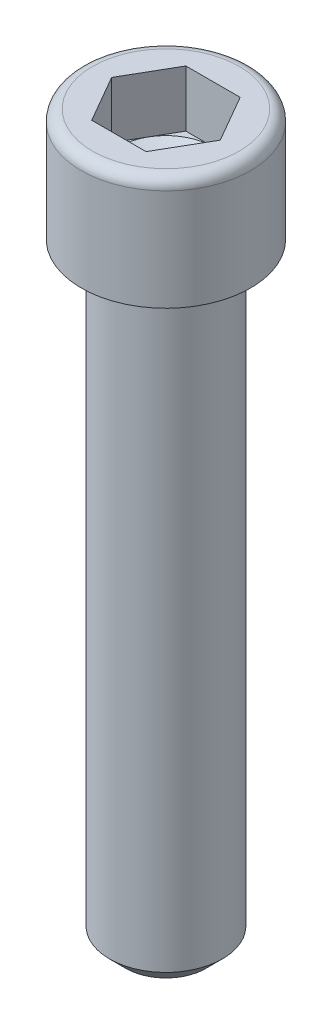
ISO-10303-21;
HEADER;
FILE_DESCRIPTION(('STEP AP214'),'2;1');
FILE_NAME('part.step','',(''),(''),'','','');
FILE_SCHEMA(('AUTOMOTIVE_DESIGN { 1 0 10303 214 1 1 1 1 }'));
ENDSEC;
DATA;
#1=APPLICATION_CONTEXT('core data for automotive mechanical design processes');
#2=APPLICATION_PROTOCOL_DEFINITION('international standard','automotive_design',2000,#1);
#3=PRODUCT_CONTEXT('',#1,'mechanical');
#4=PRODUCT('Part','Part','',(#3));
#5=PRODUCT_RELATED_PRODUCT_CATEGORY('part','',(#4));
#6=PRODUCT_DEFINITION_FORMATION('','',#4);
#7=PRODUCT_DEFINITION_CONTEXT('part definition',#1,'design');
#8=PRODUCT_DEFINITION('design','',#6,#7);
#9=PRODUCT_DEFINITION_SHAPE('','',#8);
#10=(LENGTH_UNIT() NAMED_UNIT(*) SI_UNIT(.MILLI.,.METRE.));
#11=(NAMED_UNIT(*) PLANE_ANGLE_UNIT() SI_UNIT($,.RADIAN.));
#12=(NAMED_UNIT(*) SI_UNIT($,.STERADIAN.) SOLID_ANGLE_UNIT());
#13=UNCERTAINTY_MEASURE_WITH_UNIT(LENGTH_MEASURE(1.E-05),#10,'distance_accuracy_value','');
#14=(GEOMETRIC_REPRESENTATION_CONTEXT(3) GLOBAL_UNCERTAINTY_ASSIGNED_CONTEXT((#13)) GLOBAL_UNIT_ASSIGNED_CONTEXT((#10,
#11,#12)) REPRESENTATION_CONTEXT('',''));
#15=CARTESIAN_POINT('',(0.,0.,0.));
#16=DIRECTION('',(0.,0.,1.));
#17=DIRECTION('',(1.,0.,0.));
#18=AXIS2_PLACEMENT_3D('',#15,#16,#17);
#19=CARTESIAN_POINT('',(5.,12.,0.));
#20=DIRECTION('',(0.,-1.,0.));
#21=DIRECTION('',(1.,0.,0.));
#22=AXIS2_PLACEMENT_3D('',#19,#20,#21);
#23=PLANE('',#22);
#24=CARTESIAN_POINT('',(0.,12.,0.));
#25=DIRECTION('',(0.,1.,0.));
#26=DIRECTION('',(-1.,0.,0.));
#27=AXIS2_PLACEMENT_3D('',#24,#25,#26);
#28=CIRCLE('',#27,7.8);
#29=CARTESIAN_POINT('',(-7.8,12.,0.));
#30=VERTEX_POINT('',#29);
#31=EDGE_CURVE('E139',#30,#30,#28,.T.);
#32=ORIENTED_EDGE('',*,*,#31,.T.);
#33=EDGE_LOOP('',(#32));
#34=FACE_BOUND('',#33,.T.);
#35=DIRECTION('',(0.499999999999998,0.,0.86602540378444));
#36=VECTOR('',#35,1.);
#37=CARTESIAN_POINT('',(2.88675134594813,12.,-5.));
#38=LINE('',#37,#36);
#39=CARTESIAN_POINT('',(2.88675134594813,12.,-5.));
#40=VERTEX_POINT('',#39);
#41=CARTESIAN_POINT('',(5.77350269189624,12.,0.));
#42=VERTEX_POINT('',#41);
#43=EDGE_CURVE('E371',#40,#42,#38,.T.);
#44=ORIENTED_EDGE('',*,*,#43,.T.);
#45=DIRECTION('',(-0.499999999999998,0.,0.86602540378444));
#46=VECTOR('',#45,1.);
#47=CARTESIAN_POINT('',(2.88675134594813,12.,5.));
#48=LINE('',#47,#46);
#49=CARTESIAN_POINT('',(2.88675134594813,12.,5.));
#50=VERTEX_POINT('',#49);
#51=EDGE_CURVE('E374',#42,#50,#48,.T.);
#52=ORIENTED_EDGE('',*,*,#51,.T.);
#53=DIRECTION('',(-1.,0.,0.));
#54=VECTOR('',#53,1.);
#55=CARTESIAN_POINT('',(2.88675134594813,12.,5.));
#56=LINE('',#55,#54);
#57=CARTESIAN_POINT('',(-2.88675134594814,12.,5.));
#58=VERTEX_POINT('',#57);
#59=EDGE_CURVE('E377',#50,#58,#56,.T.);
#60=ORIENTED_EDGE('',*,*,#59,.T.);
#61=DIRECTION('',(-0.499999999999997,0.,-0.86602540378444));
#62=VECTOR('',#61,1.);
#63=CARTESIAN_POINT('',(-2.88675134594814,12.,5.));
#64=LINE('',#63,#62);
#65=CARTESIAN_POINT('',(-5.77350269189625,12.,0.));
#66=VERTEX_POINT('',#65);
#67=EDGE_CURVE('E116',#58,#66,#64,.T.);
#68=ORIENTED_EDGE('',*,*,#67,.T.);
#69=DIRECTION('',(0.499999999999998,0.,-0.86602540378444));
#70=VECTOR('',#69,1.);
#71=CARTESIAN_POINT('',(-2.88675134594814,12.,-5.));
#72=LINE('',#71,#70);
#73=CARTESIAN_POINT('',(-2.88675134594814,12.,-5.));
#74=VERTEX_POINT('',#73);
#75=EDGE_CURVE('E368',#66,#74,#72,.T.);
#76=ORIENTED_EDGE('',*,*,#75,.T.);
#77=DIRECTION('',(1.,0.,0.));
#78=VECTOR('',#77,1.);
#79=CARTESIAN_POINT('',(2.88675134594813,12.,-5.));
#80=LINE('',#79,#78);
#81=EDGE_CURVE('E127',#74,#40,#80,.T.);
#82=ORIENTED_EDGE('',*,*,#81,.T.);
#83=EDGE_LOOP('',(#44,#52,#60,#68,#76,#82));
#84=FACE_BOUND('',#83,.T.);
#85=ADVANCED_FACE('F33',(#34,#84),#23,.F.);
#86=CARTESIAN_POINT('',(0.,-65.,0.));
#87=DIRECTION('',(0.,1.,0.));
#88=DIRECTION('',(0.,0.,1.));
#89=AXIS2_PLACEMENT_3D('',#86,#87,#88);
#90=CYLINDRICAL_SURFACE('',#89,6.);
#91=CARTESIAN_POINT('',(0.,-63.25,0.));
#92=DIRECTION('',(0.,1.,0.));
#93=DIRECTION('',(0.,0.,1.));
#94=AXIS2_PLACEMENT_3D('',#91,#92,#93);
#95=CIRCLE('',#94,6.);
#96=CARTESIAN_POINT('',(0.,-63.25,5.99999999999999));
#97=VERTEX_POINT('',#96);
#98=EDGE_CURVE('E41',#97,#97,#95,.T.);
#99=ORIENTED_EDGE('',*,*,#98,.T.);
#100=EDGE_LOOP('',(#99));
#101=FACE_BOUND('',#100,.T.);
#102=CARTESIAN_POINT('',(0.,0.,0.));
#103=DIRECTION('',(0.,1.,0.));
#104=DIRECTION('',(0.,0.,1.));
#105=AXIS2_PLACEMENT_3D('',#102,#103,#104);
#106=CIRCLE('',#105,6.);
#107=CARTESIAN_POINT('',(0.,0.,6.));
#108=VERTEX_POINT('',#107);
#109=EDGE_CURVE('E149',#108,#108,#106,.T.);
#110=ORIENTED_EDGE('',*,*,#109,.F.);
#111=EDGE_LOOP('',(#110));
#112=FACE_BOUND('',#111,.T.);
#113=ADVANCED_FACE('F154',(#101,#112),#90,.T.);
#114=CARTESIAN_POINT('',(0.,-65.,0.));
#115=DIRECTION('',(0.,1.,0.));
#116=DIRECTION('',(0.,0.,1.));
#117=AXIS2_PLACEMENT_3D('',#114,#115,#116);
#118=PLANE('',#117);
#119=CARTESIAN_POINT('',(0.,-65.,0.));
#120=DIRECTION('',(0.,1.,0.));
#121=DIRECTION('',(0.,0.,1.));
#122=AXIS2_PLACEMENT_3D('',#119,#120,#121);
#123=CIRCLE('',#122,4.25);
#124=CARTESIAN_POINT('',(0.,-65.,4.24999999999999));
#125=VERTEX_POINT('',#124);
#126=EDGE_CURVE('E11',#125,#125,#123,.F.);
#127=ORIENTED_EDGE('',*,*,#126,.T.);
#128=EDGE_LOOP('',(#127));
#129=FACE_BOUND('',#128,.T.);
#130=ADVANCED_FACE('F159',(#129),#118,.F.);
#131=CARTESIAN_POINT('',(0.,-63.25,0.));
#132=DIRECTION('',(0.,1.,0.));
#133=DIRECTION('',(0.,0.,1.));
#134=AXIS2_PLACEMENT_3D('',#131,#132,#133);
#135=CONICAL_SURFACE('',#134,6.,0.785398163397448);
#136=CARTESIAN_POINT('',(0.,-65.,4.24999999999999));
#137=CARTESIAN_POINT('',(0.,-64.9817708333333,4.26822916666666));
#138=CARTESIAN_POINT('',(0.,-64.9635416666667,4.28645833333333));
#139=CARTESIAN_POINT('',(0.,-64.9270833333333,4.32291666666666));
#140=CARTESIAN_POINT('',(0.,-64.9088541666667,4.34114583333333));
#141=CARTESIAN_POINT('',(0.,-64.8723958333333,4.37760416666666));
#142=CARTESIAN_POINT('',(0.,-64.8541666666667,4.39583333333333));
#143=CARTESIAN_POINT('',(0.,-64.8177083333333,4.43229166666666));
#144=CARTESIAN_POINT('',(0.,-64.7994791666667,4.45052083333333));
#145=CARTESIAN_POINT('',(0.,-64.7630208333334,4.48697916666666));
#146=CARTESIAN_POINT('',(0.,-64.7447916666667,4.50520833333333));
#147=CARTESIAN_POINT('',(0.,-64.7083333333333,4.54166666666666));
#148=CARTESIAN_POINT('',(0.,-64.6901041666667,4.55989583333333));
#149=CARTESIAN_POINT('',(0.,-64.6536458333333,4.59635416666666));
#150=CARTESIAN_POINT('',(0.,-64.6354166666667,4.61458333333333));
#151=CARTESIAN_POINT('',(0.,-64.5989583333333,4.65104166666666));
#152=CARTESIAN_POINT('',(0.,-64.5807291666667,4.66927083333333));
#153=CARTESIAN_POINT('',(0.,-64.5442708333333,4.70572916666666));
#154=CARTESIAN_POINT('',(0.,-64.5260416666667,4.72395833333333));
#155=CARTESIAN_POINT('',(0.,-64.4895833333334,4.76041666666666));
#156=CARTESIAN_POINT('',(0.,-64.4713541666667,4.77864583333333));
#157=CARTESIAN_POINT('',(0.,-64.4348958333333,4.81510416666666));
#158=CARTESIAN_POINT('',(0.,-64.4166666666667,4.83333333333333));
#159=CARTESIAN_POINT('',(0.,-64.3802083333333,4.86979166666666));
#160=CARTESIAN_POINT('',(0.,-64.3619791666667,4.88802083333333));
#161=CARTESIAN_POINT('',(0.,-64.3255208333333,4.92447916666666));
#162=CARTESIAN_POINT('',(0.,-64.3072916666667,4.94270833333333));
#163=CARTESIAN_POINT('',(0.,-64.2708333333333,4.97916666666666));
#164=CARTESIAN_POINT('',(0.,-64.2526041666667,4.99739583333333));
#165=CARTESIAN_POINT('',(0.,-64.2161458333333,5.03385416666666));
#166=CARTESIAN_POINT('',(0.,-64.1979166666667,5.05208333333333));
#167=CARTESIAN_POINT('',(0.,-64.1614583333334,5.08854166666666));
#168=CARTESIAN_POINT('',(0.,-64.1432291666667,5.10677083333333));
#169=CARTESIAN_POINT('',(0.,-64.1067708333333,5.14322916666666));
#170=CARTESIAN_POINT('',(0.,-64.0885416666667,5.16145833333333));
#171=CARTESIAN_POINT('',(0.,-64.0520833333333,5.19791666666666));
#172=CARTESIAN_POINT('',(0.,-64.0338541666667,5.21614583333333));
#173=CARTESIAN_POINT('',(0.,-63.9973958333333,5.25260416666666));
#174=CARTESIAN_POINT('',(0.,-63.9791666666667,5.27083333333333));
#175=CARTESIAN_POINT('',(0.,-63.9427083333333,5.30729166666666));
#176=CARTESIAN_POINT('',(0.,-63.9244791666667,5.32552083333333));
#177=CARTESIAN_POINT('',(0.,-63.8880208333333,5.36197916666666));
#178=CARTESIAN_POINT('',(0.,-63.8697916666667,5.38020833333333));
#179=CARTESIAN_POINT('',(0.,-63.8333333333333,5.41666666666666));
#180=CARTESIAN_POINT('',(0.,-63.8151041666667,5.43489583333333));
#181=CARTESIAN_POINT('',(0.,-63.7786458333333,5.47135416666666));
#182=CARTESIAN_POINT('',(0.,-63.7604166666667,5.48958333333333));
#183=CARTESIAN_POINT('',(0.,-63.7239583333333,5.52604166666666));
#184=CARTESIAN_POINT('',(0.,-63.7057291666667,5.54427083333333));
#185=CARTESIAN_POINT('',(0.,-63.6692708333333,5.58072916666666));
#186=CARTESIAN_POINT('',(0.,-63.6510416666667,5.59895833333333));
#187=CARTESIAN_POINT('',(0.,-63.6145833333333,5.63541666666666));
#188=CARTESIAN_POINT('',(0.,-63.5963541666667,5.65364583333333));
#189=CARTESIAN_POINT('',(0.,-63.5598958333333,5.69010416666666));
#190=CARTESIAN_POINT('',(0.,-63.5416666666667,5.70833333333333));
#191=CARTESIAN_POINT('',(0.,-63.5052083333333,5.74479166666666));
#192=CARTESIAN_POINT('',(0.,-63.4869791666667,5.76302083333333));
#193=CARTESIAN_POINT('',(0.,-63.4505208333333,5.79947916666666));
#194=CARTESIAN_POINT('',(0.,-63.4322916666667,5.81770833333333));
#195=CARTESIAN_POINT('',(0.,-63.3958333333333,5.85416666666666));
#196=CARTESIAN_POINT('',(0.,-63.3776041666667,5.87239583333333));
#197=CARTESIAN_POINT('',(0.,-63.3411458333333,5.90885416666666));
#198=CARTESIAN_POINT('',(0.,-63.3229166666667,5.92708333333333));
#199=CARTESIAN_POINT('',(0.,-63.2864583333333,5.96354166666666));
#200=CARTESIAN_POINT('',(0.,-63.2682291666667,5.98177083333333));
#201=CARTESIAN_POINT('',(0.,-63.25,5.99999999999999));
#202=B_SPLINE_CURVE_WITH_KNOTS('',3,(#136,#137,#138,#139,#140,#141,#142,#143,#144,#145,#146,
#147,#148,#149,#150,#151,#152,#153,#154,#155,#156,#157,#158,#159,#160,#161,#162,#163,#164,#165,
#166,#167,#168,#169,#170,#171,#172,#173,#174,#175,#176,#177,#178,#179,#180,#181,#182,#183,#184,
#185,#186,#187,#188,#189,#190,#191,#192,#193,#194,#195,#196,#197,#198,#199,#200,#201),
.UNSPECIFIED.,.F.,.F.,(4,2,2,2,2,2,2,2,2,2,2,2,2,2,2,2,2,2,2,2,2,2,2,2,2,2,2,2,2,2,2,2,4),(0.,
0.0773398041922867,0.154679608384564,0.23201941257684,0.309359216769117,0.386699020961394,
0.464038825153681,0.541378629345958,0.618718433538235,0.696058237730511,0.773398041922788,
0.850737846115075,0.928077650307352,1.00541745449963,1.08275725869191,1.16009706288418,
1.23743686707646,1.31477667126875,1.39211647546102,1.4694562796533,1.54679608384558,
1.62413588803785,1.70147569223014,1.77881549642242,1.85615530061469,1.93349510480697,
2.01083490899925,2.08817471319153,2.16551451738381,2.24285432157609,2.32019412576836,
2.39753392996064,2.47487373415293),.UNSPECIFIED.);
#203=EDGE_CURVE('BSEAM35',#125,#97,#202,.T.);
#204=ORIENTED_EDGE('',*,*,#126,.F.);
#205=ORIENTED_EDGE('',*,*,#98,.F.);
#206=ORIENTED_EDGE('',*,*,#203,.T.);
#207=ORIENTED_EDGE('',*,*,#203,.F.);
#208=EDGE_LOOP('',(#204,#206,#205,#207));
#209=FACE_BOUND('',#208,.T.);
#210=ADVANCED_FACE('F35',(#209),#135,.T.);
#211=CARTESIAN_POINT('',(0.,0.,0.));
#212=DIRECTION('',(0.,1.,0.));
#213=DIRECTION('',(-1.,0.,0.));
#214=AXIS2_PLACEMENT_3D('',#211,#212,#213);
#215=PLANE('',#214);
#216=ORIENTED_EDGE('',*,*,#109,.T.);
#217=EDGE_LOOP('',(#216));
#218=FACE_BOUND('',#217,.T.);
#219=CARTESIAN_POINT('',(0.,0.,0.));
#220=DIRECTION('',(0.,1.,0.));
#221=DIRECTION('',(-1.,0.,0.));
#222=AXIS2_PLACEMENT_3D('',#219,#220,#221);
#223=CIRCLE('',#222,9.);
#224=CARTESIAN_POINT('',(-9.,0.,0.));
#225=VERTEX_POINT('',#224);
#226=EDGE_CURVE('E146',#225,#225,#223,.T.);
#227=ORIENTED_EDGE('',*,*,#226,.F.);
#228=EDGE_LOOP('',(#227));
#229=FACE_BOUND('',#228,.T.);
#230=ADVANCED_FACE('F158',(#218,#229),#215,.F.);
#231=CARTESIAN_POINT('',(0.,12.,0.));
#232=DIRECTION('',(0.,1.,0.));
#233=DIRECTION('',(-1.,0.,0.));
#234=AXIS2_PLACEMENT_3D('',#231,#232,#233);
#235=CYLINDRICAL_SURFACE('',#234,9.);
#236=CARTESIAN_POINT('',(0.,10.8,0.));
#237=DIRECTION('',(0.,1.,0.));
#238=DIRECTION('',(-1.,0.,0.));
#239=AXIS2_PLACEMENT_3D('',#236,#237,#238);
#240=CIRCLE('',#239,9.);
#241=CARTESIAN_POINT('',(-9.,10.8,0.));
#242=VERTEX_POINT('',#241);
#243=EDGE_CURVE('E143',#242,#242,#240,.T.);
#244=ORIENTED_EDGE('',*,*,#243,.F.);
#245=EDGE_LOOP('',(#244));
#246=FACE_BOUND('',#245,.T.);
#247=ORIENTED_EDGE('',*,*,#226,.T.);
#248=EDGE_LOOP('',(#247));
#249=FACE_BOUND('',#248,.T.);
#250=ADVANCED_FACE('F165',(#246,#249),#235,.T.);
#251=CARTESIAN_POINT('',(0.,10.8,0.));
#252=DIRECTION('',(0.,1.,0.));
#253=DIRECTION('',(-1.,0.,0.));
#254=AXIS2_PLACEMENT_3D('',#251,#252,#253);
#255=TOROIDAL_SURFACE('',#254,7.8,1.2);
#256=ORIENTED_EDGE('',*,*,#31,.F.);
#257=EDGE_LOOP('',(#256));
#258=FACE_BOUND('',#257,.T.);
#259=ORIENTED_EDGE('',*,*,#243,.T.);
#260=EDGE_LOOP('',(#259));
#261=FACE_BOUND('',#260,.T.);
#262=ADVANCED_FACE('F182',(#258,#261),#255,.T.);
#263=CARTESIAN_POINT('',(-2.88675134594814,6.,-5.));
#264=DIRECTION('',(0.86602540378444,0.,0.499999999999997));
#265=DIRECTION('',(0.499999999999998,0.,-0.86602540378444));
#266=AXIS2_PLACEMENT_3D('',#263,#264,#265);
#267=PLANE('',#266);
#268=ORIENTED_EDGE('',*,*,#75,.F.);
#269=DIRECTION('',(0.,1.,0.));
#270=VECTOR('',#269,1.);
#271=CARTESIAN_POINT('',(-5.77350269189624,6.,0.));
#272=LINE('',#271,#270);
#273=CARTESIAN_POINT('',(-5.77350269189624,6.,0.));
#274=VERTEX_POINT('',#273);
#275=EDGE_CURVE('E363',#274,#66,#272,.T.);
#276=ORIENTED_EDGE('',*,*,#275,.F.);
#277=DIRECTION('',(0.499999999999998,0.,-0.86602540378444));
#278=VECTOR('',#277,1.);
#279=CARTESIAN_POINT('',(-2.88675134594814,6.,-5.));
#280=LINE('',#279,#278);
#281=CARTESIAN_POINT('',(-4.3301270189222,6.,-2.49999999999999));
#282=VERTEX_POINT('',#281);
#283=EDGE_CURVE('E112',#274,#282,#280,.T.);
#284=ORIENTED_EDGE('',*,*,#283,.T.);
#285=CARTESIAN_POINT('',(-2.88675134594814,6.,-5.));
#286=VERTEX_POINT('',#285);
#287=EDGE_CURVE('E106',#282,#286,#280,.T.);
#288=ORIENTED_EDGE('',*,*,#287,.T.);
#289=DIRECTION('',(0.,1.,0.));
#290=VECTOR('',#289,1.);
#291=CARTESIAN_POINT('',(-2.88675134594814,6.,-5.));
#292=LINE('',#291,#290);
#293=EDGE_CURVE('E108',#286,#74,#292,.T.);
#294=ORIENTED_EDGE('',*,*,#293,.T.);
#295=EDGE_LOOP('',(#268,#276,#284,#288,#294));
#296=FACE_BOUND('',#295,.T.);
#297=ADVANCED_FACE('F107',(#296),#267,.T.);
#298=CARTESIAN_POINT('',(2.88675134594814,6.,-5.));
#299=DIRECTION('',(0.,0.,1.));
#300=DIRECTION('',(1.,0.,0.));
#301=AXIS2_PLACEMENT_3D('',#298,#299,#300);
#302=PLANE('',#301);
#303=ORIENTED_EDGE('',*,*,#81,.F.);
#304=ORIENTED_EDGE('',*,*,#293,.F.);
#305=DIRECTION('',(1.,0.,0.));
#306=VECTOR('',#305,1.);
#307=CARTESIAN_POINT('',(2.88675134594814,6.,-5.));
#308=LINE('',#307,#306);
#309=CARTESIAN_POINT('',(0.,6.,-5.));
#310=VERTEX_POINT('',#309);
#311=EDGE_CURVE('E48',#286,#310,#308,.T.);
#312=ORIENTED_EDGE('',*,*,#311,.T.);
#313=CARTESIAN_POINT('',(2.88675134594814,6.,-5.));
#314=VERTEX_POINT('',#313);
#315=EDGE_CURVE('E122',#310,#314,#308,.T.);
#316=ORIENTED_EDGE('',*,*,#315,.T.);
#317=DIRECTION('',(0.,1.,0.));
#318=VECTOR('',#317,1.);
#319=CARTESIAN_POINT('',(2.88675134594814,6.,-5.));
#320=LINE('',#319,#318);
#321=EDGE_CURVE('E129',#314,#40,#320,.T.);
#322=ORIENTED_EDGE('',*,*,#321,.T.);
#323=EDGE_LOOP('',(#303,#304,#312,#316,#322));
#324=FACE_BOUND('',#323,.T.);
#325=ADVANCED_FACE('F124',(#324),#302,.T.);
#326=CARTESIAN_POINT('',(2.88675134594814,6.,-5.));
#327=DIRECTION('',(-0.86602540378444,0.,0.499999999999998));
#328=DIRECTION('',(0.499999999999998,0.,0.86602540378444));
#329=AXIS2_PLACEMENT_3D('',#326,#327,#328);
#330=PLANE('',#329);
#331=ORIENTED_EDGE('',*,*,#43,.F.);
#332=ORIENTED_EDGE('',*,*,#321,.F.);
#333=DIRECTION('',(0.499999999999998,0.,0.86602540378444));
#334=VECTOR('',#333,1.);
#335=CARTESIAN_POINT('',(2.88675134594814,6.,-5.));
#336=LINE('',#335,#334);
#337=CARTESIAN_POINT('',(4.3301270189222,6.,-2.49999999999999));
#338=VERTEX_POINT('',#337);
#339=EDGE_CURVE('E396',#314,#338,#336,.T.);
#340=ORIENTED_EDGE('',*,*,#339,.T.);
#341=CARTESIAN_POINT('',(5.77350269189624,6.,0.));
#342=VERTEX_POINT('',#341);
#343=EDGE_CURVE('E121',#338,#342,#336,.T.);
#344=ORIENTED_EDGE('',*,*,#343,.T.);
#345=DIRECTION('',(0.,1.,0.));
#346=VECTOR('',#345,1.);
#347=CARTESIAN_POINT('',(5.77350269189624,6.,0.));
#348=LINE('',#347,#346);
#349=EDGE_CURVE('E134',#342,#42,#348,.T.);
#350=ORIENTED_EDGE('',*,*,#349,.T.);
#351=EDGE_LOOP('',(#331,#332,#340,#344,#350));
#352=FACE_BOUND('',#351,.T.);
#353=ADVANCED_FACE('F212',(#352),#330,.T.);
#354=CARTESIAN_POINT('',(2.88675134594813,6.,5.));
#355=DIRECTION('',(-0.86602540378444,0.,-0.499999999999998));
#356=DIRECTION('',(-0.499999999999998,0.,0.86602540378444));
#357=AXIS2_PLACEMENT_3D('',#354,#355,#356);
#358=PLANE('',#357);
#359=ORIENTED_EDGE('',*,*,#51,.F.);
#360=ORIENTED_EDGE('',*,*,#349,.F.);
#361=DIRECTION('',(-0.499999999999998,0.,0.86602540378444));
#362=VECTOR('',#361,1.);
#363=CARTESIAN_POINT('',(2.88675134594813,6.,5.));
#364=LINE('',#363,#362);
#365=CARTESIAN_POINT('',(4.3301270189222,6.,2.49999999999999));
#366=VERTEX_POINT('',#365);
#367=EDGE_CURVE('E394',#342,#366,#364,.T.);
#368=ORIENTED_EDGE('',*,*,#367,.T.);
#369=CARTESIAN_POINT('',(2.88675134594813,6.,5.));
#370=VERTEX_POINT('',#369);
#371=EDGE_CURVE('E395',#366,#370,#364,.T.);
#372=ORIENTED_EDGE('',*,*,#371,.T.);
#373=DIRECTION('',(0.,1.,0.));
#374=VECTOR('',#373,1.);
#375=CARTESIAN_POINT('',(2.88675134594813,6.,5.));
#376=LINE('',#375,#374);
#377=EDGE_CURVE('E383',#370,#50,#376,.T.);
#378=ORIENTED_EDGE('',*,*,#377,.T.);
#379=EDGE_LOOP('',(#359,#360,#368,#372,#378));
#380=FACE_BOUND('',#379,.T.);
#381=ADVANCED_FACE('F219',(#380),#358,.T.);
#382=CARTESIAN_POINT('',(2.88675134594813,6.,5.));
#383=DIRECTION('',(0.,0.,-1.));
#384=DIRECTION('',(-1.,0.,0.));
#385=AXIS2_PLACEMENT_3D('',#382,#383,#384);
#386=PLANE('',#385);
#387=ORIENTED_EDGE('',*,*,#59,.F.);
#388=ORIENTED_EDGE('',*,*,#377,.F.);
#389=DIRECTION('',(-1.,0.,0.));
#390=VECTOR('',#389,1.);
#391=CARTESIAN_POINT('',(2.88675134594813,6.,5.));
#392=LINE('',#391,#390);
#393=CARTESIAN_POINT('',(0.,6.,5.));
#394=VERTEX_POINT('',#393);
#395=EDGE_CURVE('E358',#370,#394,#392,.T.);
#396=ORIENTED_EDGE('',*,*,#395,.T.);
#397=CARTESIAN_POINT('',(-2.88675134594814,6.,5.));
#398=VERTEX_POINT('',#397);
#399=EDGE_CURVE('E354',#394,#398,#392,.T.);
#400=ORIENTED_EDGE('',*,*,#399,.T.);
#401=DIRECTION('',(0.,1.,0.));
#402=VECTOR('',#401,1.);
#403=CARTESIAN_POINT('',(-2.88675134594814,6.,5.));
#404=LINE('',#403,#402);
#405=EDGE_CURVE('E362',#398,#58,#404,.T.);
#406=ORIENTED_EDGE('',*,*,#405,.T.);
#407=EDGE_LOOP('',(#387,#388,#396,#400,#406));
#408=FACE_BOUND('',#407,.T.);
#409=ADVANCED_FACE('F227',(#408),#386,.T.);
#410=CARTESIAN_POINT('',(-2.88675134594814,6.,5.));
#411=DIRECTION('',(0.86602540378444,0.,-0.499999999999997));
#412=DIRECTION('',(-0.499999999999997,0.,-0.86602540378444));
#413=AXIS2_PLACEMENT_3D('',#410,#411,#412);
#414=PLANE('',#413);
#415=ORIENTED_EDGE('',*,*,#67,.F.);
#416=ORIENTED_EDGE('',*,*,#405,.F.);
#417=DIRECTION('',(-0.499999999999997,0.,-0.86602540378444));
#418=VECTOR('',#417,1.);
#419=CARTESIAN_POINT('',(-2.88675134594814,6.,5.));
#420=LINE('',#419,#418);
#421=CARTESIAN_POINT('',(-4.3301270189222,6.,2.49999999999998));
#422=VERTEX_POINT('',#421);
#423=EDGE_CURVE('E353',#398,#422,#420,.T.);
#424=ORIENTED_EDGE('',*,*,#423,.T.);
#425=EDGE_CURVE('E356',#422,#274,#420,.T.);
#426=ORIENTED_EDGE('',*,*,#425,.T.);
#427=ORIENTED_EDGE('',*,*,#275,.T.);
#428=EDGE_LOOP('',(#415,#416,#424,#426,#427));
#429=FACE_BOUND('',#428,.T.);
#430=ADVANCED_FACE('F235',(#429),#414,.T.);
#431=CARTESIAN_POINT('',(-8.66025403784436,6.,5.));
#432=DIRECTION('',(0.,-1.,0.));
#433=DIRECTION('',(0.,0.,-1.));
#434=AXIS2_PLACEMENT_3D('',#431,#432,#433);
#435=PLANE('',#434);
#436=ORIENTED_EDGE('',*,*,#311,.F.);
#437=ORIENTED_EDGE('',*,*,#287,.F.);
#438=CARTESIAN_POINT('',(0.,6.,0.));
#439=DIRECTION('',(0.,1.,0.));
#440=DIRECTION('',(-1.,0.,0.));
#441=AXIS2_PLACEMENT_3D('',#438,#439,#440);
#442=CIRCLE('',#441,5.);
#443=EDGE_CURVE('E119',#310,#282,#442,.T.);
#444=ORIENTED_EDGE('',*,*,#443,.F.);
#445=EDGE_LOOP('',(#436,#437,#444));
#446=FACE_BOUND('',#445,.T.);
#447=ADVANCED_FACE('F118',(#446),#435,.F.);
#448=ORIENTED_EDGE('',*,*,#283,.F.);
#449=ORIENTED_EDGE('',*,*,#425,.F.);
#450=EDGE_CURVE('E128',#282,#422,#442,.T.);
#451=ORIENTED_EDGE('',*,*,#450,.F.);
#452=EDGE_LOOP('',(#448,#449,#451));
#453=FACE_BOUND('',#452,.T.);
#454=ADVANCED_FACE('F250',(#453),#435,.F.);
#455=ORIENTED_EDGE('',*,*,#423,.F.);
#456=ORIENTED_EDGE('',*,*,#399,.F.);
#457=EDGE_CURVE('E133',#422,#394,#442,.T.);
#458=ORIENTED_EDGE('',*,*,#457,.F.);
#459=EDGE_LOOP('',(#455,#456,#458));
#460=FACE_BOUND('',#459,.T.);
#461=ADVANCED_FACE('F258',(#460),#435,.F.);
#462=ORIENTED_EDGE('',*,*,#395,.F.);
#463=ORIENTED_EDGE('',*,*,#371,.F.);
#464=EDGE_CURVE('E140',#394,#366,#442,.T.);
#465=ORIENTED_EDGE('',*,*,#464,.F.);
#466=EDGE_LOOP('',(#462,#463,#465));
#467=FACE_BOUND('',#466,.T.);
#468=ADVANCED_FACE('F265',(#467),#435,.F.);
#469=ORIENTED_EDGE('',*,*,#367,.F.);
#470=ORIENTED_EDGE('',*,*,#343,.F.);
#471=EDGE_CURVE('E400',#366,#338,#442,.T.);
#472=ORIENTED_EDGE('',*,*,#471,.F.);
#473=EDGE_LOOP('',(#469,#470,#472));
#474=FACE_BOUND('',#473,.T.);
#475=ADVANCED_FACE('F272',(#474),#435,.F.);
#476=ORIENTED_EDGE('',*,*,#339,.F.);
#477=ORIENTED_EDGE('',*,*,#315,.F.);
#478=EDGE_CURVE('E399',#338,#310,#442,.T.);
#479=ORIENTED_EDGE('',*,*,#478,.F.);
#480=EDGE_LOOP('',(#476,#477,#479));
#481=FACE_BOUND('',#480,.T.);
#482=ADVANCED_FACE('F252',(#481),#435,.F.);
#483=CARTESIAN_POINT('',(0.,6.,0.));
#484=DIRECTION('',(0.,1.,0.));
#485=DIRECTION('',(-1.,0.,0.));
#486=AXIS2_PLACEMENT_3D('',#483,#484,#485);
#487=CONICAL_SURFACE('',#486,5.,1.04719755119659);
#488=CARTESIAN_POINT('',(0.,3.11324865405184,0.));
#489=VERTEX_POINT('',#488);
#490=VERTEX_LOOP('',#489);
#491=FACE_BOUND('',#490,.T.);
#492=ORIENTED_EDGE('',*,*,#457,.T.);
#493=ORIENTED_EDGE('',*,*,#464,.T.);
#494=ORIENTED_EDGE('',*,*,#471,.T.);
#495=ORIENTED_EDGE('',*,*,#478,.T.);
#496=ORIENTED_EDGE('',*,*,#443,.T.);
#497=ORIENTED_EDGE('',*,*,#450,.T.);
#498=EDGE_LOOP('',(#492,#493,#494,#495,#496,#497));
#499=FACE_BOUND('',#498,.T.);
#500=ADVANCED_FACE('F180',(#491,#499),#487,.F.);
#501=CLOSED_SHELL('',(#85,#113,#130,#210,#230,#250,#262,#297,#325,#353,#381,#409,#430,#447,#454,
#461,#468,#475,#482,#500));
#502=MANIFOLD_SOLID_BREP('B2',#501);
#503=ADVANCED_BREP_SHAPE_REPRESENTATION('',(#18,#502),#14);
#504=SHAPE_DEFINITION_REPRESENTATION(#9,#503);
ENDSEC;
END-ISO-10303-21;
